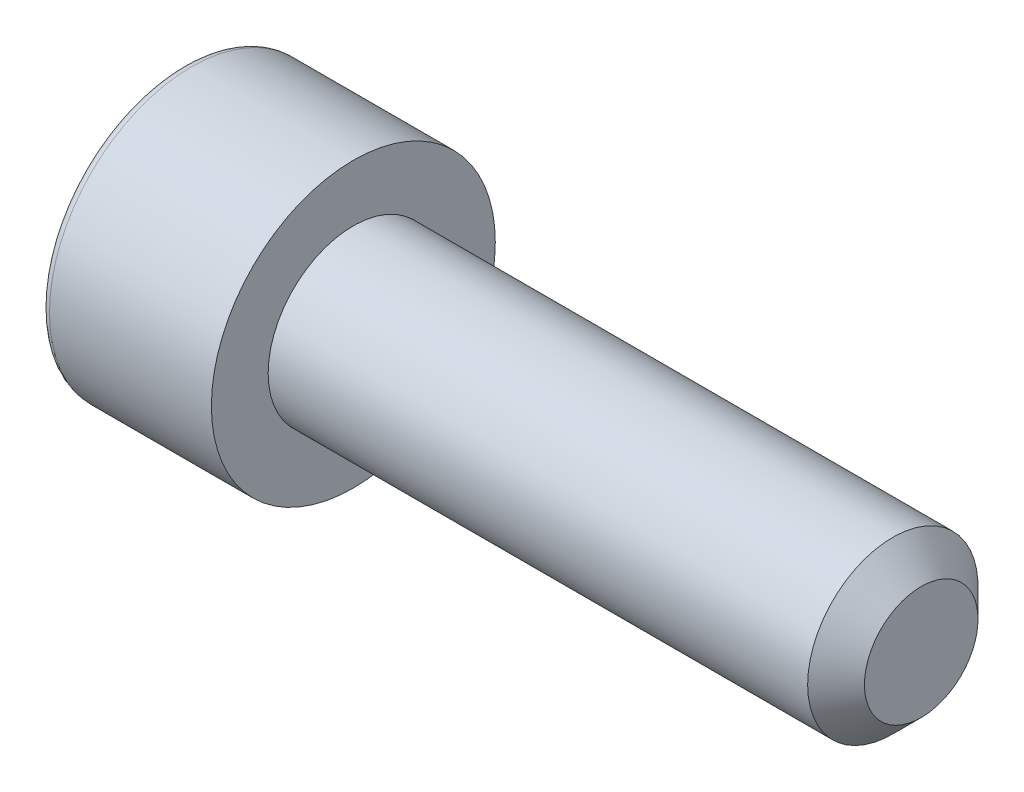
ISO-10303-21;
HEADER;
FILE_DESCRIPTION(('STEP AP214'),'2;1');
FILE_NAME('part.step','',(''),(''),'','','');
FILE_SCHEMA(('AUTOMOTIVE_DESIGN { 1 0 10303 214 1 1 1 1 }'));
ENDSEC;
DATA;
#1=APPLICATION_CONTEXT('core data for automotive mechanical design processes');
#2=APPLICATION_PROTOCOL_DEFINITION('international standard','automotive_design',2000,#1);
#3=PRODUCT_CONTEXT('',#1,'mechanical');
#4=PRODUCT('Part','Part','',(#3));
#5=PRODUCT_RELATED_PRODUCT_CATEGORY('part','',(#4));
#6=PRODUCT_DEFINITION_FORMATION('','',#4);
#7=PRODUCT_DEFINITION_CONTEXT('part definition',#1,'design');
#8=PRODUCT_DEFINITION('design','',#6,#7);
#9=PRODUCT_DEFINITION_SHAPE('','',#8);
#10=(LENGTH_UNIT() NAMED_UNIT(*) SI_UNIT(.MILLI.,.METRE.));
#11=(NAMED_UNIT(*) PLANE_ANGLE_UNIT() SI_UNIT($,.RADIAN.));
#12=(NAMED_UNIT(*) SI_UNIT($,.STERADIAN.) SOLID_ANGLE_UNIT());
#13=UNCERTAINTY_MEASURE_WITH_UNIT(LENGTH_MEASURE(1.E-05),#10,'distance_accuracy_value','');
#14=(GEOMETRIC_REPRESENTATION_CONTEXT(3) GLOBAL_UNCERTAINTY_ASSIGNED_CONTEXT((#13)) GLOBAL_UNIT_ASSIGNED_CONTEXT((#10,
#11,#12)) REPRESENTATION_CONTEXT('',''));
#15=CARTESIAN_POINT('',(0.,0.,0.));
#16=DIRECTION('',(0.,0.,1.));
#17=DIRECTION('',(1.,0.,0.));
#18=AXIS2_PLACEMENT_3D('',#15,#16,#17);
#19=CARTESIAN_POINT('',(0.,0.,0.));
#20=DIRECTION('',(-1.,0.,0.));
#21=DIRECTION('',(0.,0.,1.));
#22=AXIS2_PLACEMENT_3D('',#19,#20,#21);
#23=PLANE('',#22);
#24=DIRECTION('',(0.,-0.499999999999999,0.866025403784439));
#25=VECTOR('',#24,1.);
#26=CARTESIAN_POINT('',(0.,2.93524876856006,0.));
#27=LINE('',#26,#25);
#28=CARTESIAN_POINT('',(0.,2.93524876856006,0.));
#29=VERTEX_POINT('',#28);
#30=CARTESIAN_POINT('',(0.,1.46762438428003,2.542));
#31=VERTEX_POINT('',#30);
#32=EDGE_CURVE('E259',#29,#31,#27,.T.);
#33=ORIENTED_EDGE('',*,*,#32,.T.);
#34=DIRECTION('',(0.,1.,0.));
#35=VECTOR('',#34,1.);
#36=CARTESIAN_POINT('',(0.,-1.46762438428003,2.542));
#37=LINE('',#36,#35);
#38=CARTESIAN_POINT('',(0.,-1.46762438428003,2.542));
#39=VERTEX_POINT('',#38);
#40=EDGE_CURVE('E136',#39,#31,#37,.T.);
#41=ORIENTED_EDGE('',*,*,#40,.F.);
#42=DIRECTION('',(0.,-0.500000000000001,-0.866025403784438));
#43=VECTOR('',#42,1.);
#44=CARTESIAN_POINT('',(0.,-1.46762438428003,2.542));
#45=LINE('',#44,#43);
#46=CARTESIAN_POINT('',(0.,-2.93524876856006,0.));
#47=VERTEX_POINT('',#46);
#48=EDGE_CURVE('E262',#39,#47,#45,.T.);
#49=ORIENTED_EDGE('',*,*,#48,.T.);
#50=DIRECTION('',(0.,0.499999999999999,-0.866025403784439));
#51=VECTOR('',#50,1.);
#52=CARTESIAN_POINT('',(0.,-2.93524876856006,0.));
#53=LINE('',#52,#51);
#54=CARTESIAN_POINT('',(0.,-1.46762438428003,-2.542));
#55=VERTEX_POINT('',#54);
#56=EDGE_CURVE('E265',#47,#55,#53,.T.);
#57=ORIENTED_EDGE('',*,*,#56,.T.);
#58=DIRECTION('',(0.,-1.,0.));
#59=VECTOR('',#58,1.);
#60=CARTESIAN_POINT('',(0.,1.46762438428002,-2.542));
#61=LINE('',#60,#59);
#62=CARTESIAN_POINT('',(0.,1.46762438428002,-2.542));
#63=VERTEX_POINT('',#62);
#64=EDGE_CURVE('E268',#63,#55,#61,.T.);
#65=ORIENTED_EDGE('',*,*,#64,.F.);
#66=DIRECTION('',(0.,-0.500000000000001,-0.866025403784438));
#67=VECTOR('',#66,1.);
#68=CARTESIAN_POINT('',(0.,2.93524876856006,0.));
#69=LINE('',#68,#67);
#70=EDGE_CURVE('E131',#29,#63,#69,.T.);
#71=ORIENTED_EDGE('',*,*,#70,.F.);
#72=EDGE_LOOP('',(#33,#41,#49,#57,#65,#71));
#73=FACE_BOUND('',#72,.T.);
#74=CARTESIAN_POINT('',(0.,0.,0.));
#75=DIRECTION('',(-1.,0.,0.));
#76=DIRECTION('',(0.,0.,1.));
#77=AXIS2_PLACEMENT_3D('',#74,#75,#76);
#78=CIRCLE('',#77,4.7);
#79=CARTESIAN_POINT('',(0.,0.,4.7));
#80=VERTEX_POINT('',#79);
#81=EDGE_CURVE('E48',#80,#80,#78,.T.);
#82=ORIENTED_EDGE('',*,*,#81,.T.);
#83=EDGE_LOOP('',(#82));
#84=FACE_BOUND('',#83,.T.);
#85=ADVANCED_FACE('F40',(#73,#84),#23,.T.);
#86=CARTESIAN_POINT('',(-31.75,0.,0.));
#87=DIRECTION('',(-1.,0.,0.));
#88=DIRECTION('',(0.,0.,1.));
#89=AXIS2_PLACEMENT_3D('',#86,#87,#88);
#90=CYLINDRICAL_SURFACE('',#89,5.);
#91=CARTESIAN_POINT('',(0.300000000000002,0.,0.));
#92=DIRECTION('',(-1.,0.,0.));
#93=DIRECTION('',(0.,0.,1.));
#94=AXIS2_PLACEMENT_3D('',#91,#92,#93);
#95=CIRCLE('',#94,5.);
#96=CARTESIAN_POINT('',(0.300000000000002,0.,5.));
#97=VERTEX_POINT('',#96);
#98=EDGE_CURVE('E11',#97,#97,#95,.F.);
#99=ORIENTED_EDGE('',*,*,#98,.T.);
#100=EDGE_LOOP('',(#99));
#101=FACE_BOUND('',#100,.T.);
#102=CARTESIAN_POINT('',(6.,0.,0.));
#103=DIRECTION('',(-1.,0.,0.));
#104=DIRECTION('',(0.,0.,1.));
#105=AXIS2_PLACEMENT_3D('',#102,#103,#104);
#106=CIRCLE('',#105,5.);
#107=CARTESIAN_POINT('',(6.,0.,5.));
#108=VERTEX_POINT('',#107);
#109=EDGE_CURVE('E158',#108,#108,#106,.T.);
#110=ORIENTED_EDGE('',*,*,#109,.T.);
#111=EDGE_LOOP('',(#110));
#112=FACE_BOUND('',#111,.T.);
#113=ADVANCED_FACE('F178',(#101,#112),#90,.T.);
#114=CARTESIAN_POINT('',(6.,5.,0.));
#115=DIRECTION('',(1.,0.,0.));
#116=DIRECTION('',(0.,0.,-1.));
#117=AXIS2_PLACEMENT_3D('',#114,#115,#116);
#118=PLANE('',#117);
#119=CARTESIAN_POINT('',(6.,0.,0.));
#120=DIRECTION('',(-1.,0.,0.));
#121=DIRECTION('',(0.,0.,1.));
#122=AXIS2_PLACEMENT_3D('',#119,#120,#121);
#123=CIRCLE('',#122,3.);
#124=CARTESIAN_POINT('',(6.,0.,3.));
#125=VERTEX_POINT('',#124);
#126=EDGE_CURVE('E155',#125,#125,#123,.T.);
#127=ORIENTED_EDGE('',*,*,#126,.T.);
#128=EDGE_LOOP('',(#127));
#129=FACE_BOUND('',#128,.T.);
#130=ORIENTED_EDGE('',*,*,#109,.F.);
#131=EDGE_LOOP('',(#130));
#132=FACE_BOUND('',#131,.T.);
#133=ADVANCED_FACE('F183',(#129,#132),#118,.T.);
#134=CARTESIAN_POINT('',(-31.75,0.,0.));
#135=DIRECTION('',(-1.,0.,0.));
#136=DIRECTION('',(0.,0.,1.));
#137=AXIS2_PLACEMENT_3D('',#134,#135,#136);
#138=CYLINDRICAL_SURFACE('',#137,2.99999999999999);
#139=CARTESIAN_POINT('',(25.,0.,0.));
#140=DIRECTION('',(-1.,0.,0.));
#141=DIRECTION('',(0.,0.,1.));
#142=AXIS2_PLACEMENT_3D('',#139,#140,#141);
#143=CIRCLE('',#142,2.99999999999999);
#144=CARTESIAN_POINT('',(25.,0.,2.99999999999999));
#145=VERTEX_POINT('',#144);
#146=EDGE_CURVE('E152',#145,#145,#143,.T.);
#147=ORIENTED_EDGE('',*,*,#146,.T.);
#148=EDGE_LOOP('',(#147));
#149=FACE_BOUND('',#148,.T.);
#150=ORIENTED_EDGE('',*,*,#126,.F.);
#151=EDGE_LOOP('',(#150));
#152=FACE_BOUND('',#151,.T.);
#153=ADVANCED_FACE('F189',(#149,#152),#138,.T.);
#154=CARTESIAN_POINT('',(26.,0.,0.));
#155=DIRECTION('',(-1.,0.,0.));
#156=DIRECTION('',(0.,0.,1.));
#157=AXIS2_PLACEMENT_3D('',#154,#155,#156);
#158=CONICAL_SURFACE('',#157,2.,0.785398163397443);
#159=ORIENTED_EDGE('',*,*,#146,.F.);
#160=EDGE_LOOP('',(#159));
#161=FACE_BOUND('',#160,.T.);
#162=CARTESIAN_POINT('',(26.,0.,0.));
#163=DIRECTION('',(-1.,0.,0.));
#164=DIRECTION('',(0.,0.,1.));
#165=AXIS2_PLACEMENT_3D('',#162,#163,#164);
#166=CIRCLE('',#165,2.);
#167=CARTESIAN_POINT('',(26.,0.,2.));
#168=VERTEX_POINT('',#167);
#169=EDGE_CURVE('E147',#168,#168,#166,.T.);
#170=ORIENTED_EDGE('',*,*,#169,.T.);
#171=EDGE_LOOP('',(#170));
#172=FACE_BOUND('',#171,.T.);
#173=ADVANCED_FACE('F173',(#161,#172),#158,.T.);
#174=CARTESIAN_POINT('',(26.,2.,0.));
#175=DIRECTION('',(1.,0.,0.));
#176=DIRECTION('',(0.,0.,-1.));
#177=AXIS2_PLACEMENT_3D('',#174,#175,#176);
#178=PLANE('',#177);
#179=ORIENTED_EDGE('',*,*,#169,.F.);
#180=EDGE_LOOP('',(#179));
#181=FACE_BOUND('',#180,.T.);
#182=ADVANCED_FACE('F166',(#181),#178,.T.);
#183=CARTESIAN_POINT('',(0.300000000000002,0.,0.));
#184=DIRECTION('',(-1.,0.,0.));
#185=DIRECTION('',(0.,0.,1.));
#186=AXIS2_PLACEMENT_3D('',#183,#184,#185);
#187=TOROIDAL_SURFACE('',#186,4.7,0.3);
#188=ORIENTED_EDGE('',*,*,#98,.F.);
#189=EDGE_LOOP('',(#188));
#190=FACE_BOUND('',#189,.T.);
#191=ORIENTED_EDGE('',*,*,#81,.F.);
#192=EDGE_LOOP('',(#191));
#193=FACE_BOUND('',#192,.T.);
#194=ADVANCED_FACE('F42',(#190,#193),#187,.T.);
#195=CARTESIAN_POINT('',(3.,2.93524876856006,0.));
#196=DIRECTION('',(0.,-0.866025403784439,-0.499999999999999));
#197=DIRECTION('',(0.,0.499999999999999,-0.866025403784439));
#198=AXIS2_PLACEMENT_3D('',#195,#196,#197);
#199=PLANE('',#198);
#200=ORIENTED_EDGE('',*,*,#32,.F.);
#201=DIRECTION('',(-1.,0.,0.));
#202=VECTOR('',#201,1.);
#203=CARTESIAN_POINT('',(3.,2.93524876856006,0.));
#204=LINE('',#203,#202);
#205=CARTESIAN_POINT('',(3.,2.93524876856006,0.));
#206=VERTEX_POINT('',#205);
#207=EDGE_CURVE('E249',#206,#29,#204,.T.);
#208=ORIENTED_EDGE('',*,*,#207,.F.);
#209=DIRECTION('',(0.,-0.499999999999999,0.866025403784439));
#210=VECTOR('',#209,1.);
#211=CARTESIAN_POINT('',(3.,2.93524876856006,0.));
#212=LINE('',#211,#210);
#213=CARTESIAN_POINT('',(3.,2.20143657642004,1.271));
#214=VERTEX_POINT('',#213);
#215=EDGE_CURVE('E123',#206,#214,#212,.T.);
#216=ORIENTED_EDGE('',*,*,#215,.T.);
#217=CARTESIAN_POINT('',(3.,1.46762438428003,2.542));
#218=VERTEX_POINT('',#217);
#219=EDGE_CURVE('E114',#214,#218,#212,.T.);
#220=ORIENTED_EDGE('',*,*,#219,.T.);
#221=DIRECTION('',(-1.,0.,0.));
#222=VECTOR('',#221,1.);
#223=CARTESIAN_POINT('',(3.,1.46762438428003,2.542));
#224=LINE('',#223,#222);
#225=EDGE_CURVE('E128',#218,#31,#224,.T.);
#226=ORIENTED_EDGE('',*,*,#225,.T.);
#227=EDGE_LOOP('',(#200,#208,#216,#220,#226));
#228=FACE_BOUND('',#227,.T.);
#229=ADVANCED_FACE('F127',(#228),#199,.T.);
#230=CARTESIAN_POINT('',(3.,-1.46762438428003,2.542));
#231=DIRECTION('',(0.,0.,1.));
#232=DIRECTION('',(0.,-1.,0.));
#233=AXIS2_PLACEMENT_3D('',#230,#231,#232);
#234=PLANE('',#233);
#235=ORIENTED_EDGE('',*,*,#40,.T.);
#236=ORIENTED_EDGE('',*,*,#225,.F.);
#237=DIRECTION('',(0.,1.,0.));
#238=VECTOR('',#237,1.);
#239=CARTESIAN_POINT('',(3.,-1.46762438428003,2.542));
#240=LINE('',#239,#238);
#241=CARTESIAN_POINT('',(3.,0.,2.542));
#242=VERTEX_POINT('',#241);
#243=EDGE_CURVE('E111',#242,#218,#240,.T.);
#244=ORIENTED_EDGE('',*,*,#243,.F.);
#245=CARTESIAN_POINT('',(3.,-1.46762438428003,2.542));
#246=VERTEX_POINT('',#245);
#247=EDGE_CURVE('E122',#246,#242,#240,.T.);
#248=ORIENTED_EDGE('',*,*,#247,.F.);
#249=DIRECTION('',(-1.,0.,0.));
#250=VECTOR('',#249,1.);
#251=CARTESIAN_POINT('',(3.,-1.46762438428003,2.542));
#252=LINE('',#251,#250);
#253=EDGE_CURVE('E138',#246,#39,#252,.T.);
#254=ORIENTED_EDGE('',*,*,#253,.T.);
#255=EDGE_LOOP('',(#235,#236,#244,#248,#254));
#256=FACE_BOUND('',#255,.T.);
#257=ADVANCED_FACE('F133',(#256),#234,.F.);
#258=CARTESIAN_POINT('',(3.,-1.46762438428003,2.542));
#259=DIRECTION('',(0.,0.866025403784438,-0.500000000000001));
#260=DIRECTION('',(0.,0.500000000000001,0.866025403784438));
#261=AXIS2_PLACEMENT_3D('',#258,#259,#260);
#262=PLANE('',#261);
#263=ORIENTED_EDGE('',*,*,#48,.F.);
#264=ORIENTED_EDGE('',*,*,#253,.F.);
#265=DIRECTION('',(0.,-0.500000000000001,-0.866025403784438));
#266=VECTOR('',#265,1.);
#267=CARTESIAN_POINT('',(3.,-1.46762438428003,2.542));
#268=LINE('',#267,#266);
#269=CARTESIAN_POINT('',(3.,-2.20143657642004,1.271));
#270=VERTEX_POINT('',#269);
#271=EDGE_CURVE('E288',#246,#270,#268,.T.);
#272=ORIENTED_EDGE('',*,*,#271,.T.);
#273=CARTESIAN_POINT('',(3.,-2.93524876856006,0.));
#274=VERTEX_POINT('',#273);
#275=EDGE_CURVE('E277',#270,#274,#268,.T.);
#276=ORIENTED_EDGE('',*,*,#275,.T.);
#277=DIRECTION('',(-1.,0.,0.));
#278=VECTOR('',#277,1.);
#279=CARTESIAN_POINT('',(3.,-2.93524876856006,0.));
#280=LINE('',#279,#278);
#281=EDGE_CURVE('E143',#274,#47,#280,.T.);
#282=ORIENTED_EDGE('',*,*,#281,.T.);
#283=EDGE_LOOP('',(#263,#264,#272,#276,#282));
#284=FACE_BOUND('',#283,.T.);
#285=ADVANCED_FACE('F203',(#284),#262,.T.);
#286=CARTESIAN_POINT('',(3.,-2.93524876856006,0.));
#287=DIRECTION('',(0.,0.866025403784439,0.499999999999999));
#288=DIRECTION('',(0.,-0.499999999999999,0.866025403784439));
#289=AXIS2_PLACEMENT_3D('',#286,#287,#288);
#290=PLANE('',#289);
#291=ORIENTED_EDGE('',*,*,#56,.F.);
#292=ORIENTED_EDGE('',*,*,#281,.F.);
#293=DIRECTION('',(0.,0.499999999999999,-0.866025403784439));
#294=VECTOR('',#293,1.);
#295=CARTESIAN_POINT('',(3.,-2.93524876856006,0.));
#296=LINE('',#295,#294);
#297=CARTESIAN_POINT('',(3.,-2.20143657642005,-1.271));
#298=VERTEX_POINT('',#297);
#299=EDGE_CURVE('E255',#274,#298,#296,.T.);
#300=ORIENTED_EDGE('',*,*,#299,.T.);
#301=CARTESIAN_POINT('',(3.,-1.46762438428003,-2.542));
#302=VERTEX_POINT('',#301);
#303=EDGE_CURVE('E287',#298,#302,#296,.T.);
#304=ORIENTED_EDGE('',*,*,#303,.T.);
#305=DIRECTION('',(-1.,0.,0.));
#306=VECTOR('',#305,1.);
#307=CARTESIAN_POINT('',(3.,-1.46762438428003,-2.542));
#308=LINE('',#307,#306);
#309=EDGE_CURVE('E248',#302,#55,#308,.T.);
#310=ORIENTED_EDGE('',*,*,#309,.T.);
#311=EDGE_LOOP('',(#291,#292,#300,#304,#310));
#312=FACE_BOUND('',#311,.T.);
#313=ADVANCED_FACE('F206',(#312),#290,.T.);
#314=CARTESIAN_POINT('',(3.,1.46762438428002,-2.542));
#315=DIRECTION('',(0.,0.,-1.));
#316=DIRECTION('',(0.,1.,0.));
#317=AXIS2_PLACEMENT_3D('',#314,#315,#316);
#318=PLANE('',#317);
#319=ORIENTED_EDGE('',*,*,#64,.T.);
#320=ORIENTED_EDGE('',*,*,#309,.F.);
#321=DIRECTION('',(0.,-1.,0.));
#322=VECTOR('',#321,1.);
#323=CARTESIAN_POINT('',(3.,1.46762438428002,-2.542));
#324=LINE('',#323,#322);
#325=CARTESIAN_POINT('',(3.,0.,-2.542));
#326=VERTEX_POINT('',#325);
#327=EDGE_CURVE('E252',#326,#302,#324,.T.);
#328=ORIENTED_EDGE('',*,*,#327,.F.);
#329=CARTESIAN_POINT('',(3.,1.46762438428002,-2.542));
#330=VERTEX_POINT('',#329);
#331=EDGE_CURVE('E55',#330,#326,#324,.T.);
#332=ORIENTED_EDGE('',*,*,#331,.F.);
#333=DIRECTION('',(-1.,0.,0.));
#334=VECTOR('',#333,1.);
#335=CARTESIAN_POINT('',(3.,1.46762438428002,-2.542));
#336=LINE('',#335,#334);
#337=EDGE_CURVE('E245',#330,#63,#336,.T.);
#338=ORIENTED_EDGE('',*,*,#337,.T.);
#339=EDGE_LOOP('',(#319,#320,#328,#332,#338));
#340=FACE_BOUND('',#339,.T.);
#341=ADVANCED_FACE('F210',(#340),#318,.F.);
#342=CARTESIAN_POINT('',(3.,2.93524876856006,0.));
#343=DIRECTION('',(0.,0.866025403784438,-0.500000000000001));
#344=DIRECTION('',(0.,0.500000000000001,0.866025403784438));
#345=AXIS2_PLACEMENT_3D('',#342,#343,#344);
#346=PLANE('',#345);
#347=ORIENTED_EDGE('',*,*,#70,.T.);
#348=ORIENTED_EDGE('',*,*,#337,.F.);
#349=DIRECTION('',(0.,-0.500000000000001,-0.866025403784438));
#350=VECTOR('',#349,1.);
#351=CARTESIAN_POINT('',(3.,2.93524876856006,0.));
#352=LINE('',#351,#350);
#353=CARTESIAN_POINT('',(3.,2.20143657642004,-1.271));
#354=VERTEX_POINT('',#353);
#355=EDGE_CURVE('E235',#354,#330,#352,.T.);
#356=ORIENTED_EDGE('',*,*,#355,.F.);
#357=EDGE_CURVE('E241',#206,#354,#352,.T.);
#358=ORIENTED_EDGE('',*,*,#357,.F.);
#359=ORIENTED_EDGE('',*,*,#207,.T.);
#360=EDGE_LOOP('',(#347,#348,#356,#358,#359));
#361=FACE_BOUND('',#360,.T.);
#362=ADVANCED_FACE('F214',(#361),#346,.F.);
#363=CARTESIAN_POINT('',(3.,2.93524876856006,0.));
#364=DIRECTION('',(1.,0.,0.));
#365=DIRECTION('',(0.,0.,-1.));
#366=AXIS2_PLACEMENT_3D('',#363,#364,#365);
#367=PLANE('',#366);
#368=ORIENTED_EDGE('',*,*,#327,.T.);
#369=ORIENTED_EDGE('',*,*,#303,.F.);
#370=CARTESIAN_POINT('',(3.,0.,0.));
#371=DIRECTION('',(-1.,0.,0.));
#372=DIRECTION('',(0.,0.,1.));
#373=AXIS2_PLACEMENT_3D('',#370,#371,#372);
#374=CIRCLE('',#373,2.542);
#375=EDGE_CURVE('E283',#326,#298,#374,.T.);
#376=ORIENTED_EDGE('',*,*,#375,.F.);
#377=EDGE_LOOP('',(#368,#369,#376));
#378=FACE_BOUND('',#377,.T.);
#379=ADVANCED_FACE('F218',(#378),#367,.F.);
#380=ORIENTED_EDGE('',*,*,#299,.F.);
#381=ORIENTED_EDGE('',*,*,#275,.F.);
#382=EDGE_CURVE('E141',#298,#270,#374,.T.);
#383=ORIENTED_EDGE('',*,*,#382,.F.);
#384=EDGE_LOOP('',(#380,#381,#383));
#385=FACE_BOUND('',#384,.T.);
#386=ADVANCED_FACE('F221',(#385),#367,.F.);
#387=ORIENTED_EDGE('',*,*,#271,.F.);
#388=ORIENTED_EDGE('',*,*,#247,.T.);
#389=EDGE_CURVE('E137',#270,#242,#374,.T.);
#390=ORIENTED_EDGE('',*,*,#389,.F.);
#391=EDGE_LOOP('',(#387,#388,#390));
#392=FACE_BOUND('',#391,.T.);
#393=ADVANCED_FACE('F226',(#392),#367,.F.);
#394=ORIENTED_EDGE('',*,*,#243,.T.);
#395=ORIENTED_EDGE('',*,*,#219,.F.);
#396=EDGE_CURVE('E117',#242,#214,#374,.T.);
#397=ORIENTED_EDGE('',*,*,#396,.F.);
#398=EDGE_LOOP('',(#394,#395,#397));
#399=FACE_BOUND('',#398,.T.);
#400=ADVANCED_FACE('F113',(#399),#367,.F.);
#401=ORIENTED_EDGE('',*,*,#215,.F.);
#402=ORIENTED_EDGE('',*,*,#357,.T.);
#403=EDGE_CURVE('E148',#214,#354,#374,.T.);
#404=ORIENTED_EDGE('',*,*,#403,.F.);
#405=EDGE_LOOP('',(#401,#402,#404));
#406=FACE_BOUND('',#405,.T.);
#407=ADVANCED_FACE('F229',(#406),#367,.F.);
#408=ORIENTED_EDGE('',*,*,#355,.T.);
#409=ORIENTED_EDGE('',*,*,#331,.T.);
#410=EDGE_CURVE('E238',#354,#326,#374,.T.);
#411=ORIENTED_EDGE('',*,*,#410,.F.);
#412=EDGE_LOOP('',(#408,#409,#411));
#413=FACE_BOUND('',#412,.T.);
#414=ADVANCED_FACE('F199',(#413),#367,.F.);
#415=CARTESIAN_POINT('',(3.,0.,0.));
#416=DIRECTION('',(-1.,0.,0.));
#417=DIRECTION('',(0.,0.,1.));
#418=AXIS2_PLACEMENT_3D('',#415,#416,#417);
#419=CONICAL_SURFACE('',#418,2.542,1.04719755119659);
#420=CARTESIAN_POINT('',(4.46762438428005,0.,0.));
#421=VERTEX_POINT('',#420);
#422=VERTEX_LOOP('',#421);
#423=FACE_BOUND('',#422,.T.);
#424=ORIENTED_EDGE('',*,*,#396,.T.);
#425=ORIENTED_EDGE('',*,*,#403,.T.);
#426=ORIENTED_EDGE('',*,*,#410,.T.);
#427=ORIENTED_EDGE('',*,*,#375,.T.);
#428=ORIENTED_EDGE('',*,*,#382,.T.);
#429=ORIENTED_EDGE('',*,*,#389,.T.);
#430=EDGE_LOOP('',(#424,#425,#426,#427,#428,#429));
#431=FACE_BOUND('',#430,.T.);
#432=ADVANCED_FACE('F197',(#423,#431),#419,.F.);
#433=CLOSED_SHELL('',(#85,#113,#133,#153,#173,#182,#194,#229,#257,#285,#313,#341,#362,#379,#386,
#393,#400,#407,#414,#432));
#434=MANIFOLD_SOLID_BREP('B2',#433);
#435=ADVANCED_BREP_SHAPE_REPRESENTATION('',(#18,#434),#14);
#436=SHAPE_DEFINITION_REPRESENTATION(#9,#435);
ENDSEC;
END-ISO-10303-21;
